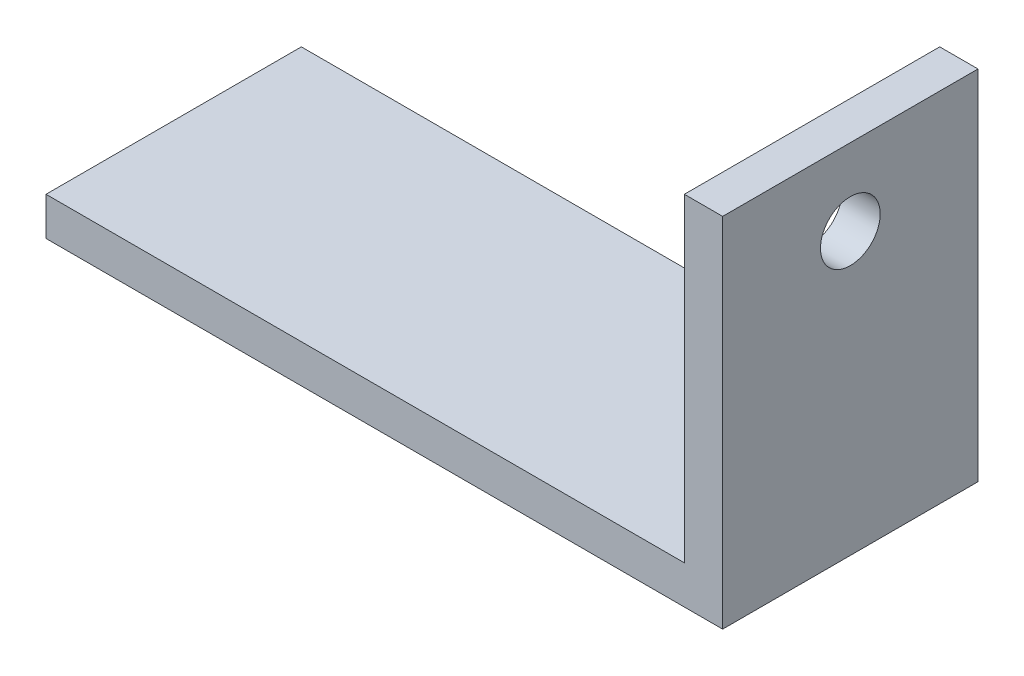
ISO-10303-21;
HEADER;
FILE_DESCRIPTION(('STEP AP214'),'2;1');
FILE_NAME('part.step','',(''),(''),'','','');
FILE_SCHEMA(('AUTOMOTIVE_DESIGN { 1 0 10303 214 1 1 1 1 }'));
ENDSEC;
DATA;
#1=APPLICATION_CONTEXT('core data for automotive mechanical design processes');
#2=APPLICATION_PROTOCOL_DEFINITION('international standard','automotive_design',2000,#1);
#3=PRODUCT_CONTEXT('',#1,'mechanical');
#4=PRODUCT('Part','Part','',(#3));
#5=PRODUCT_RELATED_PRODUCT_CATEGORY('part','',(#4));
#6=PRODUCT_DEFINITION_FORMATION('','',#4);
#7=PRODUCT_DEFINITION_CONTEXT('part definition',#1,'design');
#8=PRODUCT_DEFINITION('design','',#6,#7);
#9=PRODUCT_DEFINITION_SHAPE('','',#8);
#10=(LENGTH_UNIT() NAMED_UNIT(*) SI_UNIT(.MILLI.,.METRE.));
#11=(NAMED_UNIT(*) PLANE_ANGLE_UNIT() SI_UNIT($,.RADIAN.));
#12=(NAMED_UNIT(*) SI_UNIT($,.STERADIAN.) SOLID_ANGLE_UNIT());
#13=UNCERTAINTY_MEASURE_WITH_UNIT(LENGTH_MEASURE(1.E-05),#10,'distance_accuracy_value','');
#14=(GEOMETRIC_REPRESENTATION_CONTEXT(3) GLOBAL_UNCERTAINTY_ASSIGNED_CONTEXT((#13)) GLOBAL_UNIT_ASSIGNED_CONTEXT((#10,
#11,#12)) REPRESENTATION_CONTEXT('',''));
#15=CARTESIAN_POINT('',(0.,0.,0.));
#16=DIRECTION('',(0.,0.,1.));
#17=DIRECTION('',(1.,0.,0.));
#18=AXIS2_PLACEMENT_3D('',#15,#16,#17);
#19=CARTESIAN_POINT('',(0.,0.,20.));
#20=DIRECTION('',(0.,-1.,0.));
#21=DIRECTION('',(0.,0.,-1.));
#22=AXIS2_PLACEMENT_3D('',#19,#20,#21);
#23=PLANE('',#22);
#24=DIRECTION('',(-1.,0.,0.));
#25=VECTOR('',#24,1.);
#26=CARTESIAN_POINT('',(0.,0.,0.));
#27=LINE('',#26,#25);
#28=CARTESIAN_POINT('',(3.,0.,0.));
#29=VERTEX_POINT('',#28);
#30=CARTESIAN_POINT('',(0.,0.,0.));
#31=VERTEX_POINT('',#30);
#32=EDGE_CURVE('E126',#29,#31,#27,.T.);
#33=ORIENTED_EDGE('',*,*,#32,.T.);
#34=DIRECTION('',(0.,0.,-1.));
#35=VECTOR('',#34,1.);
#36=CARTESIAN_POINT('',(0.,0.,20.));
#37=LINE('',#36,#35);
#38=CARTESIAN_POINT('',(0.,0.,20.));
#39=VERTEX_POINT('',#38);
#40=EDGE_CURVE('E11',#39,#31,#37,.T.);
#41=ORIENTED_EDGE('',*,*,#40,.F.);
#42=DIRECTION('',(-1.,0.,0.));
#43=VECTOR('',#42,1.);
#44=CARTESIAN_POINT('',(0.,0.,20.));
#45=LINE('',#44,#43);
#46=CARTESIAN_POINT('',(3.,0.,20.));
#47=VERTEX_POINT('',#46);
#48=EDGE_CURVE('E137',#47,#39,#45,.T.);
#49=ORIENTED_EDGE('',*,*,#48,.F.);
#50=DIRECTION('',(0.,0.,-1.));
#51=VECTOR('',#50,1.);
#52=CARTESIAN_POINT('',(3.,0.,20.));
#53=LINE('',#52,#51);
#54=EDGE_CURVE('E122',#47,#29,#53,.T.);
#55=ORIENTED_EDGE('',*,*,#54,.T.);
#56=EDGE_LOOP('',(#33,#41,#49,#55));
#57=FACE_BOUND('',#56,.T.);
#58=ADVANCED_FACE('F42',(#57),#23,.F.);
#59=CARTESIAN_POINT('',(0.,0.,20.));
#60=DIRECTION('',(1.,0.,0.));
#61=DIRECTION('',(0.,1.,0.));
#62=AXIS2_PLACEMENT_3D('',#59,#60,#61);
#63=PLANE('',#62);
#64=CARTESIAN_POINT('',(0.,-6.,10.));
#65=DIRECTION('',(1.,0.,0.));
#66=DIRECTION('',(0.,1.,0.));
#67=AXIS2_PLACEMENT_3D('',#64,#65,#66);
#68=CIRCLE('',#67,2.34);
#69=CARTESIAN_POINT('',(0.,-3.66,10.));
#70=VERTEX_POINT('',#69);
#71=EDGE_CURVE('E130',#70,#70,#68,.T.);
#72=ORIENTED_EDGE('',*,*,#71,.T.);
#73=EDGE_LOOP('',(#72));
#74=FACE_BOUND('',#73,.T.);
#75=DIRECTION('',(0.,-1.,0.));
#76=VECTOR('',#75,1.);
#77=CARTESIAN_POINT('',(0.,0.,0.));
#78=LINE('',#77,#76);
#79=CARTESIAN_POINT('',(0.,-25.,0.));
#80=VERTEX_POINT('',#79);
#81=EDGE_CURVE('E129',#31,#80,#78,.T.);
#82=ORIENTED_EDGE('',*,*,#81,.T.);
#83=DIRECTION('',(0.,0.,-1.));
#84=VECTOR('',#83,1.);
#85=CARTESIAN_POINT('',(0.,-25.,20.));
#86=LINE('',#85,#84);
#87=CARTESIAN_POINT('',(0.,-25.,20.));
#88=VERTEX_POINT('',#87);
#89=EDGE_CURVE('E50',#88,#80,#86,.T.);
#90=ORIENTED_EDGE('',*,*,#89,.F.);
#91=DIRECTION('',(0.,-1.,0.));
#92=VECTOR('',#91,1.);
#93=CARTESIAN_POINT('',(0.,0.,20.));
#94=LINE('',#93,#92);
#95=EDGE_CURVE('E95',#39,#88,#94,.T.);
#96=ORIENTED_EDGE('',*,*,#95,.F.);
#97=ORIENTED_EDGE('',*,*,#40,.T.);
#98=EDGE_LOOP('',(#82,#90,#96,#97));
#99=FACE_BOUND('',#98,.T.);
#100=ADVANCED_FACE('F163',(#74,#99),#63,.F.);
#101=CARTESIAN_POINT('',(0.,-25.,20.));
#102=DIRECTION('',(0.,-1.,0.));
#103=DIRECTION('',(1.,0.,0.));
#104=AXIS2_PLACEMENT_3D('',#101,#102,#103);
#105=PLANE('',#104);
#106=DIRECTION('',(-1.,0.,0.));
#107=VECTOR('',#106,1.);
#108=CARTESIAN_POINT('',(0.,-25.,0.));
#109=LINE('',#108,#107);
#110=CARTESIAN_POINT('',(-50.,-25.,0.));
#111=VERTEX_POINT('',#110);
#112=EDGE_CURVE('E132',#80,#111,#109,.T.);
#113=ORIENTED_EDGE('',*,*,#112,.T.);
#114=DIRECTION('',(0.,0.,-1.));
#115=VECTOR('',#114,1.);
#116=CARTESIAN_POINT('',(-50.,-25.,20.));
#117=LINE('',#116,#115);
#118=CARTESIAN_POINT('',(-50.,-25.,20.));
#119=VERTEX_POINT('',#118);
#120=EDGE_CURVE('E117',#119,#111,#117,.T.);
#121=ORIENTED_EDGE('',*,*,#120,.F.);
#122=DIRECTION('',(-1.,0.,0.));
#123=VECTOR('',#122,1.);
#124=CARTESIAN_POINT('',(0.,-25.,20.));
#125=LINE('',#124,#123);
#126=EDGE_CURVE('E108',#88,#119,#125,.T.);
#127=ORIENTED_EDGE('',*,*,#126,.F.);
#128=ORIENTED_EDGE('',*,*,#89,.T.);
#129=EDGE_LOOP('',(#113,#121,#127,#128));
#130=FACE_BOUND('',#129,.T.);
#131=ADVANCED_FACE('F143',(#130),#105,.F.);
#132=CARTESIAN_POINT('',(-50.,-25.,20.));
#133=DIRECTION('',(1.,0.,0.));
#134=DIRECTION('',(0.,0.,-1.));
#135=AXIS2_PLACEMENT_3D('',#132,#133,#134);
#136=PLANE('',#135);
#137=DIRECTION('',(0.,-1.,0.));
#138=VECTOR('',#137,1.);
#139=CARTESIAN_POINT('',(-50.,-25.,0.));
#140=LINE('',#139,#138);
#141=CARTESIAN_POINT('',(-50.,-28.,0.));
#142=VERTEX_POINT('',#141);
#143=EDGE_CURVE('E116',#111,#142,#140,.T.);
#144=ORIENTED_EDGE('',*,*,#143,.T.);
#145=DIRECTION('',(0.,0.,-1.));
#146=VECTOR('',#145,1.);
#147=CARTESIAN_POINT('',(-50.,-28.,20.));
#148=LINE('',#147,#146);
#149=CARTESIAN_POINT('',(-50.,-28.,20.));
#150=VERTEX_POINT('',#149);
#151=EDGE_CURVE('E113',#150,#142,#148,.T.);
#152=ORIENTED_EDGE('',*,*,#151,.F.);
#153=DIRECTION('',(0.,-1.,0.));
#154=VECTOR('',#153,1.);
#155=CARTESIAN_POINT('',(-50.,-25.,20.));
#156=LINE('',#155,#154);
#157=EDGE_CURVE('E102',#119,#150,#156,.T.);
#158=ORIENTED_EDGE('',*,*,#157,.F.);
#159=ORIENTED_EDGE('',*,*,#120,.T.);
#160=EDGE_LOOP('',(#144,#152,#158,#159));
#161=FACE_BOUND('',#160,.T.);
#162=ADVANCED_FACE('F114',(#161),#136,.F.);
#163=CARTESIAN_POINT('',(3.,-28.,20.));
#164=DIRECTION('',(0.,1.,0.));
#165=DIRECTION('',(-1.,0.,0.));
#166=AXIS2_PLACEMENT_3D('',#163,#164,#165);
#167=PLANE('',#166);
#168=DIRECTION('',(1.,0.,0.));
#169=VECTOR('',#168,1.);
#170=CARTESIAN_POINT('',(3.,-28.,0.));
#171=LINE('',#170,#169);
#172=CARTESIAN_POINT('',(3.,-28.,0.));
#173=VERTEX_POINT('',#172);
#174=EDGE_CURVE('E81',#142,#173,#171,.T.);
#175=ORIENTED_EDGE('',*,*,#174,.T.);
#176=DIRECTION('',(0.,0.,-1.));
#177=VECTOR('',#176,1.);
#178=CARTESIAN_POINT('',(3.,-28.,20.));
#179=LINE('',#178,#177);
#180=CARTESIAN_POINT('',(3.,-28.,20.));
#181=VERTEX_POINT('',#180);
#182=EDGE_CURVE('E118',#181,#173,#179,.T.);
#183=ORIENTED_EDGE('',*,*,#182,.F.);
#184=DIRECTION('',(1.,0.,0.));
#185=VECTOR('',#184,1.);
#186=CARTESIAN_POINT('',(3.,-28.,20.));
#187=LINE('',#186,#185);
#188=EDGE_CURVE('E106',#150,#181,#187,.T.);
#189=ORIENTED_EDGE('',*,*,#188,.F.);
#190=ORIENTED_EDGE('',*,*,#151,.T.);
#191=EDGE_LOOP('',(#175,#183,#189,#190));
#192=FACE_BOUND('',#191,.T.);
#193=ADVANCED_FACE('F120',(#192),#167,.F.);
#194=CARTESIAN_POINT('',(3.,0.,20.));
#195=DIRECTION('',(-1.,0.,0.));
#196=DIRECTION('',(0.,-1.,0.));
#197=AXIS2_PLACEMENT_3D('',#194,#195,#196);
#198=PLANE('',#197);
#199=CARTESIAN_POINT('',(3.,-6.,10.));
#200=DIRECTION('',(1.,0.,0.));
#201=DIRECTION('',(0.,0.,-1.));
#202=AXIS2_PLACEMENT_3D('',#199,#200,#201);
#203=CIRCLE('',#202,2.34);
#204=CARTESIAN_POINT('',(3.,-6.,7.66));
#205=VERTEX_POINT('',#204);
#206=EDGE_CURVE('E266',#205,#205,#203,.T.);
#207=ORIENTED_EDGE('',*,*,#206,.F.);
#208=EDGE_LOOP('',(#207));
#209=FACE_BOUND('',#208,.T.);
#210=DIRECTION('',(0.,1.,0.));
#211=VECTOR('',#210,1.);
#212=CARTESIAN_POINT('',(3.,0.,0.));
#213=LINE('',#212,#211);
#214=EDGE_CURVE('E87',#173,#29,#213,.T.);
#215=ORIENTED_EDGE('',*,*,#214,.T.);
#216=ORIENTED_EDGE('',*,*,#54,.F.);
#217=DIRECTION('',(0.,1.,0.));
#218=VECTOR('',#217,1.);
#219=CARTESIAN_POINT('',(3.,0.,20.));
#220=LINE('',#219,#218);
#221=EDGE_CURVE('E58',#181,#47,#220,.T.);
#222=ORIENTED_EDGE('',*,*,#221,.F.);
#223=ORIENTED_EDGE('',*,*,#182,.T.);
#224=EDGE_LOOP('',(#215,#216,#222,#223));
#225=FACE_BOUND('',#224,.T.);
#226=ADVANCED_FACE('F150',(#209,#225),#198,.F.);
#227=CARTESIAN_POINT('',(0.,0.,20.));
#228=DIRECTION('',(0.,0.,-1.));
#229=DIRECTION('',(-1.,0.,0.));
#230=AXIS2_PLACEMENT_3D('',#227,#228,#229);
#231=PLANE('',#230);
#232=ORIENTED_EDGE('',*,*,#48,.T.);
#233=ORIENTED_EDGE('',*,*,#95,.T.);
#234=ORIENTED_EDGE('',*,*,#126,.T.);
#235=ORIENTED_EDGE('',*,*,#157,.T.);
#236=ORIENTED_EDGE('',*,*,#188,.T.);
#237=ORIENTED_EDGE('',*,*,#221,.T.);
#238=EDGE_LOOP('',(#232,#233,#234,#235,#236,#237));
#239=FACE_BOUND('',#238,.T.);
#240=ADVANCED_FACE('F104',(#239),#231,.F.);
#241=CARTESIAN_POINT('',(0.,0.,0.));
#242=DIRECTION('',(0.,0.,-1.));
#243=DIRECTION('',(-1.,0.,0.));
#244=AXIS2_PLACEMENT_3D('',#241,#242,#243);
#245=PLANE('',#244);
#246=ORIENTED_EDGE('',*,*,#32,.F.);
#247=ORIENTED_EDGE('',*,*,#214,.F.);
#248=ORIENTED_EDGE('',*,*,#174,.F.);
#249=ORIENTED_EDGE('',*,*,#143,.F.);
#250=ORIENTED_EDGE('',*,*,#112,.F.);
#251=ORIENTED_EDGE('',*,*,#81,.F.);
#252=EDGE_LOOP('',(#246,#247,#248,#249,#250,#251));
#253=FACE_BOUND('',#252,.T.);
#254=ADVANCED_FACE('F146',(#253),#245,.T.);
#255=CARTESIAN_POINT('',(-17.,-6.,10.));
#256=DIRECTION('',(1.,0.,0.));
#257=DIRECTION('',(0.,0.,-1.));
#258=AXIS2_PLACEMENT_3D('',#255,#256,#257);
#259=CYLINDRICAL_SURFACE('',#258,2.34);
#260=ORIENTED_EDGE('',*,*,#206,.T.);
#261=EDGE_LOOP('',(#260));
#262=FACE_BOUND('',#261,.T.);
#263=ORIENTED_EDGE('',*,*,#71,.F.);
#264=EDGE_LOOP('',(#263));
#265=FACE_BOUND('',#264,.T.);
#266=ADVANCED_FACE('F204',(#262,#265),#259,.F.);
#267=CLOSED_SHELL('',(#58,#100,#131,#162,#193,#226,#240,#254,#266));
#268=MANIFOLD_SOLID_BREP('B2',#267);
#269=ADVANCED_BREP_SHAPE_REPRESENTATION('',(#18,#268),#14);
#270=SHAPE_DEFINITION_REPRESENTATION(#9,#269);
ENDSEC;
END-ISO-10303-21;
